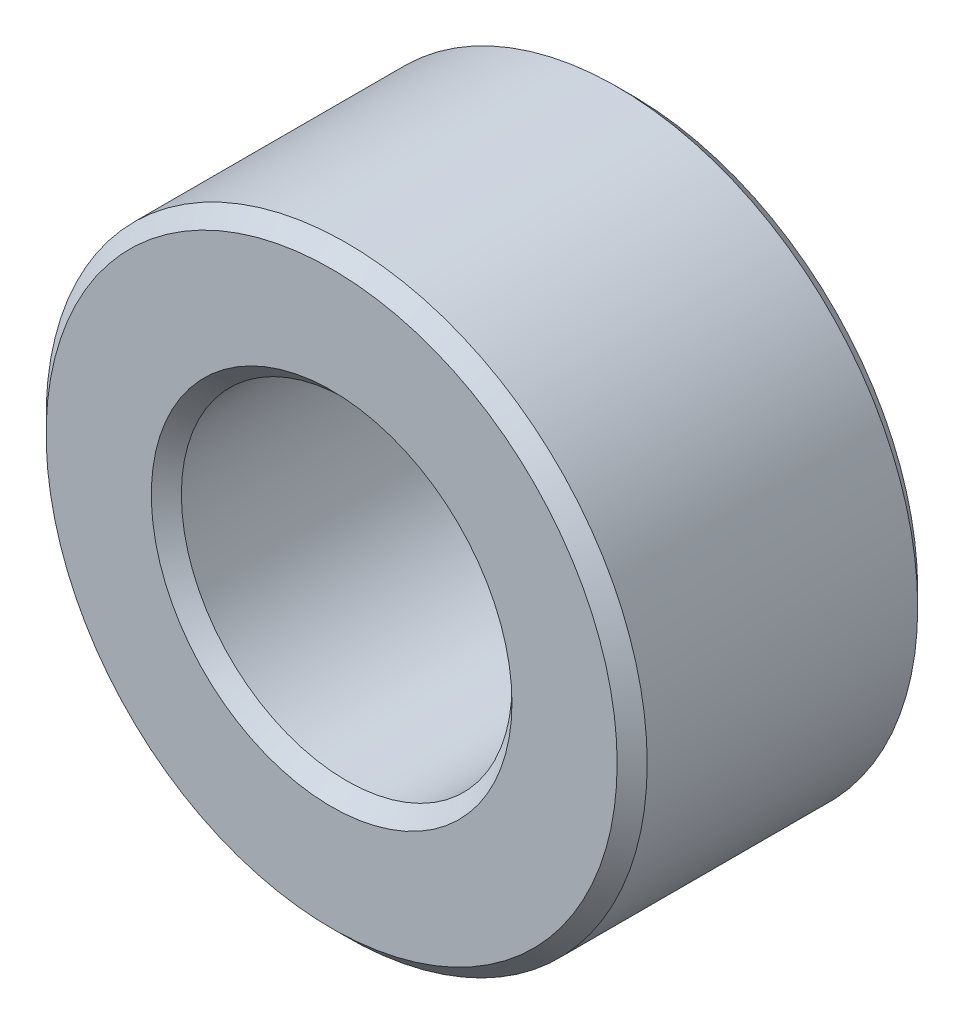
ISO-10303-21;
HEADER;
FILE_DESCRIPTION(('STEP AP214'),'2;1');
FILE_NAME('part.step','',(''),(''),'','','');
FILE_SCHEMA(('AUTOMOTIVE_DESIGN { 1 0 10303 214 1 1 1 1 }'));
ENDSEC;
DATA;
#1=APPLICATION_CONTEXT('core data for automotive mechanical design processes');
#2=APPLICATION_PROTOCOL_DEFINITION('international standard','automotive_design',2000,#1);
#3=PRODUCT_CONTEXT('',#1,'mechanical');
#4=PRODUCT('Part','Part','',(#3));
#5=PRODUCT_RELATED_PRODUCT_CATEGORY('part','',(#4));
#6=PRODUCT_DEFINITION_FORMATION('','',#4);
#7=PRODUCT_DEFINITION_CONTEXT('part definition',#1,'design');
#8=PRODUCT_DEFINITION('design','',#6,#7);
#9=PRODUCT_DEFINITION_SHAPE('','',#8);
#10=(LENGTH_UNIT() NAMED_UNIT(*) SI_UNIT(.MILLI.,.METRE.));
#11=(NAMED_UNIT(*) PLANE_ANGLE_UNIT() SI_UNIT($,.RADIAN.));
#12=(NAMED_UNIT(*) SI_UNIT($,.STERADIAN.) SOLID_ANGLE_UNIT());
#13=UNCERTAINTY_MEASURE_WITH_UNIT(LENGTH_MEASURE(1.E-05),#10,'distance_accuracy_value','');
#14=(GEOMETRIC_REPRESENTATION_CONTEXT(3) GLOBAL_UNCERTAINTY_ASSIGNED_CONTEXT((#13)) GLOBAL_UNIT_ASSIGNED_CONTEXT((#10,
#11,#12)) REPRESENTATION_CONTEXT('',''));
#15=CARTESIAN_POINT('',(0.,0.,0.));
#16=DIRECTION('',(0.,0.,1.));
#17=DIRECTION('',(1.,0.,0.));
#18=AXIS2_PLACEMENT_3D('',#15,#16,#17);
#19=CARTESIAN_POINT('',(0.,0.,1.));
#20=DIRECTION('',(0.,0.,1.));
#21=DIRECTION('',(1.,0.,0.));
#22=AXIS2_PLACEMENT_3D('',#19,#20,#21);
#23=PLANE('',#22);
#24=CARTESIAN_POINT('',(0.,0.,1.));
#25=DIRECTION('',(0.,0.,1.));
#26=DIRECTION('',(1.,0.,0.));
#27=AXIS2_PLACEMENT_3D('',#24,#25,#26);
#28=CIRCLE('',#27,1.2);
#29=CARTESIAN_POINT('',(1.2,0.,1.));
#30=VERTEX_POINT('',#29);
#31=EDGE_CURVE('E10',#30,#30,#28,.F.);
#32=ORIENTED_EDGE('',*,*,#31,.T.);
#33=EDGE_LOOP('',(#32));
#34=FACE_BOUND('',#33,.T.);
#35=CARTESIAN_POINT('',(0.,0.,1.));
#36=DIRECTION('',(0.,0.,1.));
#37=DIRECTION('',(1.,0.,0.));
#38=AXIS2_PLACEMENT_3D('',#35,#36,#37);
#39=CIRCLE('',#38,1.9);
#40=CARTESIAN_POINT('',(1.9,0.,1.));
#41=VERTEX_POINT('',#40);
#42=EDGE_CURVE('E45',#41,#41,#39,.T.);
#43=ORIENTED_EDGE('',*,*,#42,.T.);
#44=EDGE_LOOP('',(#43));
#45=FACE_BOUND('',#44,.T.);
#46=ADVANCED_FACE('F37',(#34,#45),#23,.T.);
#47=CARTESIAN_POINT('',(0.,0.,-1.));
#48=DIRECTION('',(0.,0.,1.));
#49=DIRECTION('',(1.,0.,0.));
#50=AXIS2_PLACEMENT_3D('',#47,#48,#49);
#51=PLANE('',#50);
#52=CARTESIAN_POINT('',(0.,0.,-1.));
#53=DIRECTION('',(0.,0.,1.));
#54=DIRECTION('',(1.,0.,0.));
#55=AXIS2_PLACEMENT_3D('',#52,#53,#54);
#56=CIRCLE('',#55,1.9);
#57=CARTESIAN_POINT('',(1.9,0.,-1.));
#58=VERTEX_POINT('',#57);
#59=EDGE_CURVE('E63',#58,#58,#56,.F.);
#60=ORIENTED_EDGE('',*,*,#59,.T.);
#61=EDGE_LOOP('',(#60));
#62=FACE_BOUND('',#61,.T.);
#63=CARTESIAN_POINT('',(0.,0.,-1.));
#64=DIRECTION('',(0.,0.,1.));
#65=DIRECTION('',(1.,0.,0.));
#66=AXIS2_PLACEMENT_3D('',#63,#64,#65);
#67=CIRCLE('',#66,1.2);
#68=CARTESIAN_POINT('',(1.2,0.,-1.));
#69=VERTEX_POINT('',#68);
#70=EDGE_CURVE('E66',#69,#69,#67,.T.);
#71=ORIENTED_EDGE('',*,*,#70,.T.);
#72=EDGE_LOOP('',(#71));
#73=FACE_BOUND('',#72,.T.);
#74=ADVANCED_FACE('F89',(#62,#73),#51,.F.);
#75=CARTESIAN_POINT('',(0.,0.,1.));
#76=DIRECTION('',(0.,0.,-1.));
#77=DIRECTION('',(-1.,0.,0.));
#78=AXIS2_PLACEMENT_3D('',#75,#76,#77);
#79=CYLINDRICAL_SURFACE('',#78,2.);
#80=CARTESIAN_POINT('',(0.,0.,-0.900000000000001));
#81=DIRECTION('',(0.,0.,1.));
#82=DIRECTION('',(1.,0.,0.));
#83=AXIS2_PLACEMENT_3D('',#80,#81,#82);
#84=CIRCLE('',#83,2.);
#85=CARTESIAN_POINT('',(2.,0.,-0.900000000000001));
#86=VERTEX_POINT('',#85);
#87=EDGE_CURVE('E70',#86,#86,#84,.T.);
#88=ORIENTED_EDGE('',*,*,#87,.T.);
#89=EDGE_LOOP('',(#88));
#90=FACE_BOUND('',#89,.T.);
#91=CARTESIAN_POINT('',(0.,0.,0.9));
#92=DIRECTION('',(0.,0.,1.));
#93=DIRECTION('',(1.,0.,0.));
#94=AXIS2_PLACEMENT_3D('',#91,#92,#93);
#95=CIRCLE('',#94,2.);
#96=CARTESIAN_POINT('',(2.,0.,0.9));
#97=VERTEX_POINT('',#96);
#98=EDGE_CURVE('E74',#97,#97,#95,.F.);
#99=ORIENTED_EDGE('',*,*,#98,.T.);
#100=EDGE_LOOP('',(#99));
#101=FACE_BOUND('',#100,.T.);
#102=ADVANCED_FACE('F78',(#90,#101),#79,.T.);
#103=CARTESIAN_POINT('',(0.,0.,1.));
#104=DIRECTION('',(0.,0.,-1.));
#105=DIRECTION('',(-1.,0.,0.));
#106=AXIS2_PLACEMENT_3D('',#103,#104,#105);
#107=CYLINDRICAL_SURFACE('',#106,1.1);
#108=CARTESIAN_POINT('',(0.,0.,-0.9));
#109=DIRECTION('',(0.,0.,1.));
#110=DIRECTION('',(1.,0.,0.));
#111=AXIS2_PLACEMENT_3D('',#108,#109,#110);
#112=CIRCLE('',#111,1.1);
#113=CARTESIAN_POINT('',(1.1,0.,-0.9));
#114=VERTEX_POINT('',#113);
#115=EDGE_CURVE('E51',#114,#114,#112,.F.);
#116=ORIENTED_EDGE('',*,*,#115,.T.);
#117=EDGE_LOOP('',(#116));
#118=FACE_BOUND('',#117,.T.);
#119=CARTESIAN_POINT('',(0.,0.,0.900000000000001));
#120=DIRECTION('',(0.,0.,1.));
#121=DIRECTION('',(1.,0.,0.));
#122=AXIS2_PLACEMENT_3D('',#119,#120,#121);
#123=CIRCLE('',#122,1.1);
#124=CARTESIAN_POINT('',(1.1,0.,0.900000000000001));
#125=VERTEX_POINT('',#124);
#126=EDGE_CURVE('E57',#125,#125,#123,.T.);
#127=ORIENTED_EDGE('',*,*,#126,.T.);
#128=EDGE_LOOP('',(#127));
#129=FACE_BOUND('',#128,.T.);
#130=ADVANCED_FACE('F97',(#118,#129),#107,.F.);
#131=CARTESIAN_POINT('',(0.,0.,-0.900000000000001));
#132=DIRECTION('',(0.,0.,1.));
#133=DIRECTION('',(1.,0.,0.));
#134=AXIS2_PLACEMENT_3D('',#131,#132,#133);
#135=CONICAL_SURFACE('',#134,2.,0.785398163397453);
#136=ORIENTED_EDGE('',*,*,#59,.F.);
#137=EDGE_LOOP('',(#136));
#138=FACE_BOUND('',#137,.T.);
#139=ORIENTED_EDGE('',*,*,#87,.F.);
#140=EDGE_LOOP('',(#139));
#141=FACE_BOUND('',#140,.T.);
#142=ADVANCED_FACE('F102',(#138,#141),#135,.T.);
#143=CARTESIAN_POINT('',(0.,0.,-1.));
#144=DIRECTION('',(0.,0.,-1.));
#145=DIRECTION('',(-1.,0.,0.));
#146=AXIS2_PLACEMENT_3D('',#143,#144,#145);
#147=CONICAL_SURFACE('',#146,1.2,0.785398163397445);
#148=ORIENTED_EDGE('',*,*,#115,.F.);
#149=EDGE_LOOP('',(#148));
#150=FACE_BOUND('',#149,.T.);
#151=ORIENTED_EDGE('',*,*,#70,.F.);
#152=EDGE_LOOP('',(#151));
#153=FACE_BOUND('',#152,.T.);
#154=ADVANCED_FACE('F86',(#150,#153),#147,.F.);
#155=CARTESIAN_POINT('',(0.,0.,0.900000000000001));
#156=DIRECTION('',(0.,0.,1.));
#157=DIRECTION('',(1.,0.,0.));
#158=AXIS2_PLACEMENT_3D('',#155,#156,#157);
#159=CONICAL_SURFACE('',#158,1.1,0.785398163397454);
#160=ORIENTED_EDGE('',*,*,#31,.F.);
#161=EDGE_LOOP('',(#160));
#162=FACE_BOUND('',#161,.T.);
#163=ORIENTED_EDGE('',*,*,#126,.F.);
#164=EDGE_LOOP('',(#163));
#165=FACE_BOUND('',#164,.T.);
#166=ADVANCED_FACE('F82',(#162,#165),#159,.F.);
#167=CARTESIAN_POINT('',(0.,0.,1.));
#168=DIRECTION('',(0.,0.,-1.));
#169=DIRECTION('',(-1.,0.,0.));
#170=AXIS2_PLACEMENT_3D('',#167,#168,#169);
#171=CONICAL_SURFACE('',#170,1.9,0.785398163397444);
#172=ORIENTED_EDGE('',*,*,#98,.F.);
#173=EDGE_LOOP('',(#172));
#174=FACE_BOUND('',#173,.T.);
#175=ORIENTED_EDGE('',*,*,#42,.F.);
#176=EDGE_LOOP('',(#175));
#177=FACE_BOUND('',#176,.T.);
#178=ADVANCED_FACE('F39',(#174,#177),#171,.T.);
#179=CLOSED_SHELL('',(#46,#74,#102,#130,#142,#154,#166,#178));
#180=MANIFOLD_SOLID_BREP('B2',#179);
#181=ADVANCED_BREP_SHAPE_REPRESENTATION('',(#18,#180),#14);
#182=SHAPE_DEFINITION_REPRESENTATION(#9,#181);
ENDSEC;
END-ISO-10303-21;
